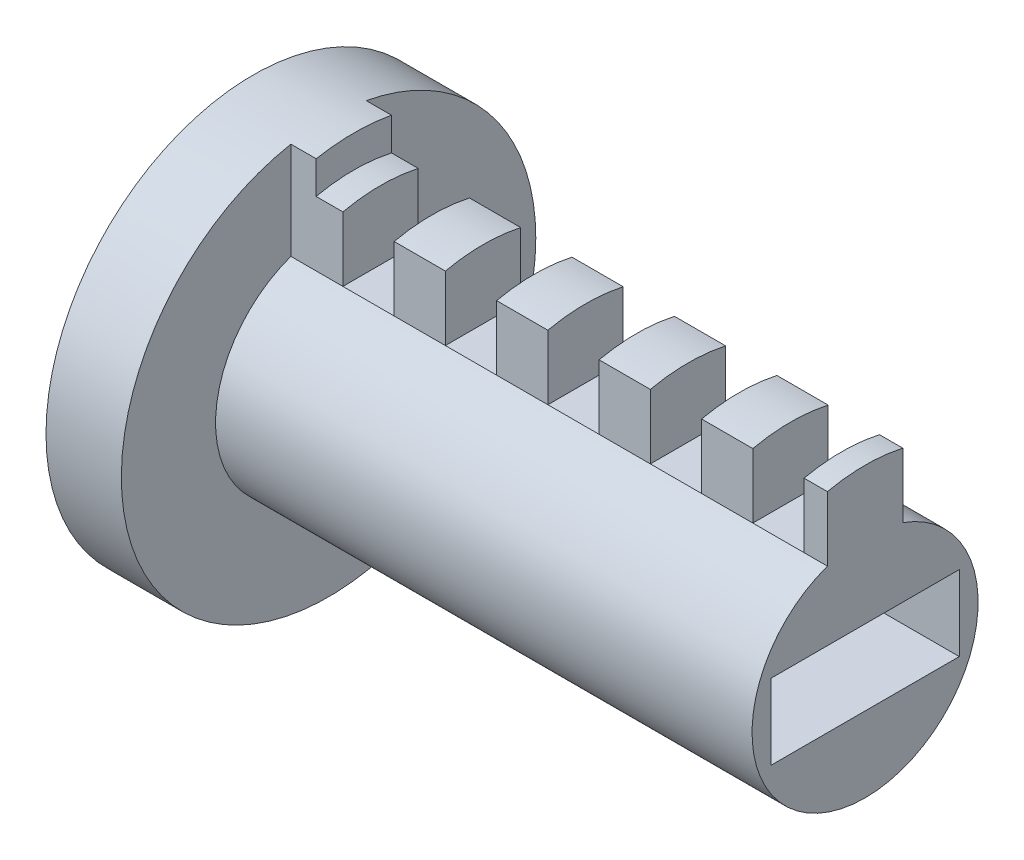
from build123d import *

# Parameters (mm, degrees)
SKETCH3_W           = 12.7
SKETCH3_H           = 5.08
BOSS_EXTRUDE3_DEPTH = 38.1
SKETCH4_W           = 3.4544
SKETCH4_H           = 7.348551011
CUT_EXTRUDE1_DEPTH  = 13.97
BOSS_EXTRUDE4_START = -5.08
SKETCH5_R           = 13.97
SKETCH5_R_2         = 11.811
SKETCH5_R_3         = 10.441234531
BOSS_EXTRUDE4_DEPTH = 5.08
BOSS_EXTRUDE5_DEPTH = 1.7018
SKETCH7_W           = 1.9304
SKETCH7_H           = 25.461326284
CUT_EXTRUDE2_DEPTH  = 12.7


with BuildPart() as part:
    # Sketch3 → Boss-Extrude3 (new body)
    with BuildSketch(Plane(origin=(0, 0, 0), x_dir=(0, 0, -1), z_dir=(1, 0, 0))):
        with BuildLine():
            ThreePointArc((-2.54, 7.184204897), (0, -7.62), (2.54, 7.184204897))
            Line((2.54, 7.184204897), (2.54, 11.534648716))
            ThreePointArc((2.54, 11.534648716), (0, 11.811), (-2.54, 11.534648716))
            Line((-2.54, 11.534648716), (-2.54, 7.184204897))
        make_face()
        Rectangle(SKETCH3_W, SKETCH3_H, mode=Mode.SUBTRACT)
    extrude(amount=BOSS_EXTRUDE3_DEPTH)

    # Sketch4 → Cut-Extrude1 (cut, symmetric)
    with BuildSketch(Plane.XY):
        with Locations((32.8676, 10.858480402)):
            Rectangle(SKETCH4_W, SKETCH4_H)
        with Locations((25.9588, 10.858480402)):
            Rectangle(SKETCH4_W, SKETCH4_H)
        with Locations((19.05, 10.858480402)):
            Rectangle(SKETCH4_W, SKETCH4_H)
        with Locations((12.1412, 10.858480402)):
            Rectangle(SKETCH4_W, SKETCH4_H)
        with Locations((5.2324, 10.858480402)):
            Rectangle(SKETCH4_W, SKETCH4_H)
    extrude(amount=CUT_EXTRUDE1_DEPTH, both=True, mode=Mode.SUBTRACT)

    # Sketch5 → Boss-Extrude4 (add)
    # profile 1 of 3: a face of its own
    with BuildSketch(Plane(origin=(0, 0, 0), x_dir=(0, 0, -1), z_dir=(1, 0, 0)).offset(BOSS_EXTRUDE4_START)):
        Circle(SKETCH5_R)
        Circle(SKETCH5_R_2, mode=Mode.SUBTRACT)
    # profile 2 of 3: a face of its own
    with BuildSketch(Plane(origin=(0, 0, 0), x_dir=(0, 0, -1), z_dir=(1, 0, 0)).offset(BOSS_EXTRUDE4_START)):
        Circle(SKETCH5_R_2)
        Circle(SKETCH5_R_3, mode=Mode.SUBTRACT)
    # profile 3 of 3: a face of its own
    with BuildSketch(Plane(origin=(0, 0, 0), x_dir=(0, 0, -1), z_dir=(1, 0, 0)).offset(BOSS_EXTRUDE4_START)):
        Circle(SKETCH5_R_2)
    extrude(amount=BOSS_EXTRUDE4_DEPTH)

    # Sketch6 → Boss-Extrude5 (add)
    with BuildSketch(Plane(origin=(0, 0, 0), x_dir=(0, 0, -1), z_dir=(1, 0, 0))):
        with BuildLine():
            Line((-2.54, 13.73715036), (-2.54, 11.794601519))
            ThreePointArc((-2.54, 11.794601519), (0, 12.065), (2.54, 11.794601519))
            Line((2.54, 11.794601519), (2.54, 13.73715036))
            ThreePointArc((2.54, 13.73715036), (0, 13.97), (-2.54, 13.73715036))
        make_face()
        with BuildLine():
            Line((-2.54, 11.794601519), (-2.54, 11.534648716))
            ThreePointArc((-2.54, 11.534648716), (0, 11.811), (2.54, 11.534648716))
            Line((2.54, 11.534648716), (2.54, 11.794601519))
            ThreePointArc((2.54, 11.794601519), (0, 12.065), (-2.54, 11.794601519))
        make_face()
    extrude(amount=BOSS_EXTRUDE5_DEPTH)

    # Sketch7 → Cut-Extrude2 (cut, symmetric)
    with BuildSketch(Plane.XY):
        with Locations((37.1348, 5.110663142)):
            Rectangle(SKETCH7_W, SKETCH7_H)
    extrude(amount=CUT_EXTRUDE2_DEPTH, both=True, mode=Mode.SUBTRACT)


solid = part.part
